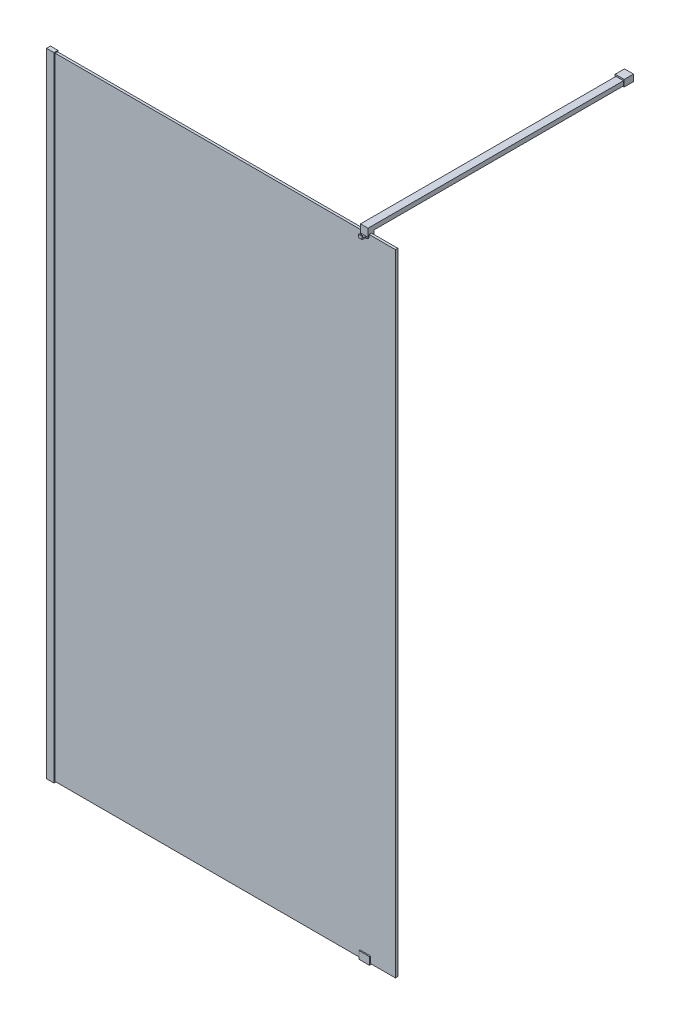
ISO-10303-21;
HEADER;
FILE_DESCRIPTION(('STEP AP214'),'2;1');
FILE_NAME('part.step','',(''),(''),'','','');
FILE_SCHEMA(('AUTOMOTIVE_DESIGN { 1 0 10303 214 1 1 1 1 }'));
ENDSEC;
DATA;
#1=APPLICATION_CONTEXT('core data for automotive mechanical design processes');
#2=APPLICATION_PROTOCOL_DEFINITION('international standard','automotive_design',2000,#1);
#3=PRODUCT_CONTEXT('',#1,'mechanical');
#4=PRODUCT('Part','Part','',(#3));
#5=PRODUCT_RELATED_PRODUCT_CATEGORY('part','',(#4));
#6=PRODUCT_DEFINITION_FORMATION('','',#4);
#7=PRODUCT_DEFINITION_CONTEXT('part definition',#1,'design');
#8=PRODUCT_DEFINITION('design','',#6,#7);
#9=PRODUCT_DEFINITION_SHAPE('','',#8);
#10=(LENGTH_UNIT() NAMED_UNIT(*) SI_UNIT(.MILLI.,.METRE.));
#11=(NAMED_UNIT(*) PLANE_ANGLE_UNIT() SI_UNIT($,.RADIAN.));
#12=(NAMED_UNIT(*) SI_UNIT($,.STERADIAN.) SOLID_ANGLE_UNIT());
#13=UNCERTAINTY_MEASURE_WITH_UNIT(LENGTH_MEASURE(1.E-05),#10,'distance_accuracy_value','');
#14=(GEOMETRIC_REPRESENTATION_CONTEXT(3) GLOBAL_UNCERTAINTY_ASSIGNED_CONTEXT((#13)) GLOBAL_UNIT_ASSIGNED_CONTEXT((#10,
#11,#12)) REPRESENTATION_CONTEXT('',''));
#15=CARTESIAN_POINT('',(0.,0.,0.));
#16=DIRECTION('',(0.,0.,1.));
#17=DIRECTION('',(1.,0.,0.));
#18=AXIS2_PLACEMENT_3D('',#15,#16,#17);
#19=CARTESIAN_POINT('',(1070.95,2090.,-19.4000000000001));
#20=DIRECTION('',(-1.,0.,0.));
#21=DIRECTION('',(0.,0.,1.));
#22=AXIS2_PLACEMENT_3D('',#19,#20,#21);
#23=PLANE('',#22);
#24=DIRECTION('',(0.,-1.,0.));
#25=VECTOR('',#24,1.);
#26=CARTESIAN_POINT('',(1070.95,2090.,-850.03));
#27=LINE('',#26,#25);
#28=CARTESIAN_POINT('',(1070.95,2120.,-850.03));
#29=VERTEX_POINT('',#28);
#30=CARTESIAN_POINT('',(1070.95,2105.,-850.03));
#31=VERTEX_POINT('',#30);
#32=EDGE_CURVE('E61',#29,#31,#27,.T.);
#33=ORIENTED_EDGE('',*,*,#32,.F.);
#34=DIRECTION('',(0.,0.,1.));
#35=VECTOR('',#34,1.);
#36=CARTESIAN_POINT('',(1070.95,2120.,0.599999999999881));
#37=LINE('',#36,#35);
#38=CARTESIAN_POINT('',(1070.95,2120.,0.599999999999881));
#39=VERTEX_POINT('',#38);
#40=EDGE_CURVE('E386',#29,#39,#37,.T.);
#41=ORIENTED_EDGE('',*,*,#40,.T.);
#42=DIRECTION('',(0.,-1.,0.));
#43=VECTOR('',#42,1.);
#44=CARTESIAN_POINT('',(1070.95,2094.,0.599999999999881));
#45=LINE('',#44,#43);
#46=CARTESIAN_POINT('',(1070.95,2094.,0.599999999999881));
#47=VERTEX_POINT('',#46);
#48=EDGE_CURVE('E388',#39,#47,#45,.T.);
#49=ORIENTED_EDGE('',*,*,#48,.T.);
#50=DIRECTION('',(0.,1.,0.));
#51=VECTOR('',#50,1.);
#52=CARTESIAN_POINT('',(1070.95,2090.,0.599999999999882));
#53=LINE('',#52,#51);
#54=CARTESIAN_POINT('',(1070.95,2090.,0.599999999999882));
#55=VERTEX_POINT('',#54);
#56=EDGE_CURVE('E332',#55,#47,#53,.T.);
#57=ORIENTED_EDGE('',*,*,#56,.F.);
#58=DIRECTION('',(0.,0.,-1.));
#59=VECTOR('',#58,1.);
#60=CARTESIAN_POINT('',(1070.95,2090.,-3.40000000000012));
#61=LINE('',#60,#59);
#62=CARTESIAN_POINT('',(1070.95,2090.,-3.40000000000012));
#63=VERTEX_POINT('',#62);
#64=EDGE_CURVE('E362',#55,#63,#61,.T.);
#65=ORIENTED_EDGE('',*,*,#64,.T.);
#66=DIRECTION('',(0.,1.,-1.30407837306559E-13));
#67=VECTOR('',#66,1.);
#68=CARTESIAN_POINT('',(1070.95,2100.,-3.40000000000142));
#69=LINE('',#68,#67);
#70=CARTESIAN_POINT('',(1070.95,2100.,-3.40000000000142));
#71=VERTEX_POINT('',#70);
#72=EDGE_CURVE('E392',#63,#71,#69,.T.);
#73=ORIENTED_EDGE('',*,*,#72,.T.);
#74=DIRECTION('',(0.,0.,-1.));
#75=VECTOR('',#74,1.);
#76=CARTESIAN_POINT('',(1070.95,2100.,-11.4000000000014));
#77=LINE('',#76,#75);
#78=CARTESIAN_POINT('',(1070.95,2100.,-11.4000000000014));
#79=VERTEX_POINT('',#78);
#80=EDGE_CURVE('E394',#71,#79,#77,.T.);
#81=ORIENTED_EDGE('',*,*,#80,.T.);
#82=DIRECTION('',(0.,-1.,1.30451205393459E-13));
#83=VECTOR('',#82,1.);
#84=CARTESIAN_POINT('',(1070.95,2090.,-11.4000000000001));
#85=LINE('',#84,#83);
#86=CARTESIAN_POINT('',(1070.95,2090.,-11.4000000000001));
#87=VERTEX_POINT('',#86);
#88=EDGE_CURVE('E395',#79,#87,#85,.T.);
#89=ORIENTED_EDGE('',*,*,#88,.T.);
#90=DIRECTION('',(0.,0.,-1.));
#91=VECTOR('',#90,1.);
#92=CARTESIAN_POINT('',(1070.95,2090.,-19.4000000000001));
#93=LINE('',#92,#91);
#94=CARTESIAN_POINT('',(1070.95,2090.,-19.4000000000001));
#95=VERTEX_POINT('',#94);
#96=EDGE_CURVE('E283',#87,#95,#93,.T.);
#97=ORIENTED_EDGE('',*,*,#96,.T.);
#98=DIRECTION('',(0.,1.,0.));
#99=VECTOR('',#98,1.);
#100=CARTESIAN_POINT('',(1070.95,2120.,-19.4000000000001));
#101=LINE('',#100,#99);
#102=CARTESIAN_POINT('',(1070.95,2105.,-19.4000000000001));
#103=VERTEX_POINT('',#102);
#104=EDGE_CURVE('E249',#95,#103,#101,.T.);
#105=ORIENTED_EDGE('',*,*,#104,.T.);
#106=DIRECTION('',(0.,0.,-1.));
#107=VECTOR('',#106,1.);
#108=CARTESIAN_POINT('',(1070.95,2105.,-881.03));
#109=LINE('',#108,#107);
#110=EDGE_CURVE('E248',#103,#31,#109,.T.);
#111=ORIENTED_EDGE('',*,*,#110,.T.);
#112=EDGE_LOOP('',(#33,#41,#49,#57,#65,#73,#81,#89,#97,#105,#111));
#113=FACE_BOUND('',#112,.T.);
#114=ADVANCED_FACE('F46',(#113),#23,.F.);
#115=CARTESIAN_POINT('',(1045.95,2090.,-19.4000000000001));
#116=DIRECTION('',(-1.,0.,0.));
#117=DIRECTION('',(0.,0.,1.));
#118=AXIS2_PLACEMENT_3D('',#115,#116,#117);
#119=PLANE('',#118);
#120=DIRECTION('',(0.,0.,1.));
#121=VECTOR('',#120,1.);
#122=CARTESIAN_POINT('',(1045.95,2120.,0.599999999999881));
#123=LINE('',#122,#121);
#124=CARTESIAN_POINT('',(1045.95,2120.,-850.03));
#125=VERTEX_POINT('',#124);
#126=CARTESIAN_POINT('',(1045.95,2120.,0.599999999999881));
#127=VERTEX_POINT('',#126);
#128=EDGE_CURVE('E272',#125,#127,#123,.T.);
#129=ORIENTED_EDGE('',*,*,#128,.F.);
#130=DIRECTION('',(0.,-1.,0.));
#131=VECTOR('',#130,1.);
#132=CARTESIAN_POINT('',(1045.95,2090.,-850.03));
#133=LINE('',#132,#131);
#134=CARTESIAN_POINT('',(1045.95,2105.,-850.03));
#135=VERTEX_POINT('',#134);
#136=EDGE_CURVE('E230',#125,#135,#133,.T.);
#137=ORIENTED_EDGE('',*,*,#136,.T.);
#138=DIRECTION('',(0.,0.,1.));
#139=VECTOR('',#138,1.);
#140=CARTESIAN_POINT('',(1045.95,2105.,-881.03));
#141=LINE('',#140,#139);
#142=CARTESIAN_POINT('',(1045.95,2105.,-19.4000000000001));
#143=VERTEX_POINT('',#142);
#144=EDGE_CURVE('E238',#135,#143,#141,.T.);
#145=ORIENTED_EDGE('',*,*,#144,.T.);
#146=DIRECTION('',(0.,1.,0.));
#147=VECTOR('',#146,1.);
#148=CARTESIAN_POINT('',(1045.95,2120.,-19.4000000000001));
#149=LINE('',#148,#147);
#150=CARTESIAN_POINT('',(1045.95,2090.,-19.4000000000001));
#151=VERTEX_POINT('',#150);
#152=EDGE_CURVE('E262',#151,#143,#149,.T.);
#153=ORIENTED_EDGE('',*,*,#152,.F.);
#154=DIRECTION('',(0.,0.,-1.));
#155=VECTOR('',#154,1.);
#156=CARTESIAN_POINT('',(1045.95,2090.,-19.4000000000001));
#157=LINE('',#156,#155);
#158=CARTESIAN_POINT('',(1045.95,2090.,-11.4000000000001));
#159=VERTEX_POINT('',#158);
#160=EDGE_CURVE('E296',#159,#151,#157,.T.);
#161=ORIENTED_EDGE('',*,*,#160,.F.);
#162=DIRECTION('',(0.,-1.,1.30451205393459E-13));
#163=VECTOR('',#162,1.);
#164=CARTESIAN_POINT('',(1045.95,2090.,-11.4000000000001));
#165=LINE('',#164,#163);
#166=CARTESIAN_POINT('',(1045.95,2100.,-11.4000000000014));
#167=VERTEX_POINT('',#166);
#168=EDGE_CURVE('E294',#167,#159,#165,.T.);
#169=ORIENTED_EDGE('',*,*,#168,.F.);
#170=DIRECTION('',(0.,0.,-1.));
#171=VECTOR('',#170,1.);
#172=CARTESIAN_POINT('',(1045.95,2100.,-11.4000000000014));
#173=LINE('',#172,#171);
#174=CARTESIAN_POINT('',(1045.95,2100.,-3.40000000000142));
#175=VERTEX_POINT('',#174);
#176=EDGE_CURVE('E292',#175,#167,#173,.T.);
#177=ORIENTED_EDGE('',*,*,#176,.F.);
#178=DIRECTION('',(0.,1.,-1.30407837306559E-13));
#179=VECTOR('',#178,1.);
#180=CARTESIAN_POINT('',(1045.95,2100.,-3.40000000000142));
#181=LINE('',#180,#179);
#182=CARTESIAN_POINT('',(1045.95,2090.,-3.40000000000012));
#183=VERTEX_POINT('',#182);
#184=EDGE_CURVE('E290',#183,#175,#181,.T.);
#185=ORIENTED_EDGE('',*,*,#184,.F.);
#186=DIRECTION('',(0.,0.,-1.));
#187=VECTOR('',#186,1.);
#188=CARTESIAN_POINT('',(1045.95,2090.,-3.40000000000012));
#189=LINE('',#188,#187);
#190=CARTESIAN_POINT('',(1045.95,2090.,0.599999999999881));
#191=VERTEX_POINT('',#190);
#192=EDGE_CURVE('E288',#191,#183,#189,.T.);
#193=ORIENTED_EDGE('',*,*,#192,.F.);
#194=DIRECTION('',(0.,1.,0.));
#195=VECTOR('',#194,1.);
#196=CARTESIAN_POINT('',(1045.95,2090.,0.599999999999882));
#197=LINE('',#196,#195);
#198=CARTESIAN_POINT('',(1045.95,2094.,0.599999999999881));
#199=VERTEX_POINT('',#198);
#200=EDGE_CURVE('E329',#191,#199,#197,.T.);
#201=ORIENTED_EDGE('',*,*,#200,.T.);
#202=DIRECTION('',(0.,-1.,0.));
#203=VECTOR('',#202,1.);
#204=CARTESIAN_POINT('',(1045.95,2094.,0.599999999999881));
#205=LINE('',#204,#203);
#206=EDGE_CURVE('E274',#127,#199,#205,.T.);
#207=ORIENTED_EDGE('',*,*,#206,.F.);
#208=EDGE_LOOP('',(#129,#137,#145,#153,#161,#169,#177,#185,#193,#201,#207));
#209=FACE_BOUND('',#208,.T.);
#210=ADVANCED_FACE('F259',(#209),#119,.T.);
#211=CARTESIAN_POINT('',(1070.95,2120.,0.599999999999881));
#212=DIRECTION('',(0.,-1.,0.));
#213=DIRECTION('',(0.,0.,-1.));
#214=AXIS2_PLACEMENT_3D('',#211,#212,#213);
#215=PLANE('',#214);
#216=DIRECTION('',(1.,0.,0.));
#217=VECTOR('',#216,1.);
#218=CARTESIAN_POINT('',(1070.95,2120.,-850.03));
#219=LINE('',#218,#217);
#220=EDGE_CURVE('E68',#125,#29,#219,.T.);
#221=ORIENTED_EDGE('',*,*,#220,.F.);
#222=ORIENTED_EDGE('',*,*,#128,.T.);
#223=DIRECTION('',(-1.,0.,0.));
#224=VECTOR('',#223,1.);
#225=CARTESIAN_POINT('',(1070.95,2120.,0.599999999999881));
#226=LINE('',#225,#224);
#227=EDGE_CURVE('E326',#39,#127,#226,.T.);
#228=ORIENTED_EDGE('',*,*,#227,.F.);
#229=ORIENTED_EDGE('',*,*,#40,.F.);
#230=EDGE_LOOP('',(#221,#222,#228,#229));
#231=FACE_BOUND('',#230,.T.);
#232=ADVANCED_FACE('F437',(#231),#215,.F.);
#233=CARTESIAN_POINT('',(1045.95,2105.,-19.4000000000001));
#234=DIRECTION('',(0.,1.,0.));
#235=DIRECTION('',(0.,0.,1.));
#236=AXIS2_PLACEMENT_3D('',#233,#234,#235);
#237=PLANE('',#236);
#238=DIRECTION('',(-1.,0.,0.));
#239=VECTOR('',#238,1.);
#240=CARTESIAN_POINT('',(1045.95,2105.,-850.03));
#241=LINE('',#240,#239);
#242=EDGE_CURVE('E12',#31,#135,#241,.T.);
#243=ORIENTED_EDGE('',*,*,#242,.F.);
#244=ORIENTED_EDGE('',*,*,#110,.F.);
#245=DIRECTION('',(1.,0.,0.));
#246=VECTOR('',#245,1.);
#247=CARTESIAN_POINT('',(1045.95,2105.,-19.4000000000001));
#248=LINE('',#247,#246);
#249=EDGE_CURVE('E244',#143,#103,#248,.T.);
#250=ORIENTED_EDGE('',*,*,#249,.F.);
#251=ORIENTED_EDGE('',*,*,#144,.F.);
#252=EDGE_LOOP('',(#243,#244,#250,#251));
#253=FACE_BOUND('',#252,.T.);
#254=ADVANCED_FACE('F265',(#253),#237,.F.);
#255=CARTESIAN_POINT('',(1070.95,2094.,9.84506801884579));
#256=DIRECTION('',(0.,-1.,0.));
#257=DIRECTION('',(0.,0.,-1.));
#258=AXIS2_PLACEMENT_3D('',#255,#256,#257);
#259=PLANE('',#258);
#260=DIRECTION('',(-0.906307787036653,0.,-0.422618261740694));
#261=VECTOR('',#260,1.);
#262=CARTESIAN_POINT('',(1070.02591161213,2094.,11.8267819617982));
#263=LINE('',#262,#261);
#264=CARTESIAN_POINT('',(1052.45,2094.,3.6309997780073));
#265=VERTEX_POINT('',#264);
#266=EDGE_CURVE('E365',#265,#199,#263,.T.);
#267=ORIENTED_EDGE('',*,*,#266,.F.);
#268=DIRECTION('',(0.,0.,-1.));
#269=VECTOR('',#268,1.);
#270=CARTESIAN_POINT('',(1052.45,2094.,9.84506801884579));
#271=LINE('',#270,#269);
#272=CARTESIAN_POINT('',(1052.45,2094.,9.84506801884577));
#273=VERTEX_POINT('',#272);
#274=EDGE_CURVE('E273',#273,#265,#271,.T.);
#275=ORIENTED_EDGE('',*,*,#274,.F.);
#276=DIRECTION('',(-1.,0.,0.));
#277=VECTOR('',#276,1.);
#278=CARTESIAN_POINT('',(1070.95,2094.,9.84506801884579));
#279=LINE('',#278,#277);
#280=CARTESIAN_POINT('',(1064.45,2094.,9.84506801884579));
#281=VERTEX_POINT('',#280);
#282=EDGE_CURVE('E320',#281,#273,#279,.T.);
#283=ORIENTED_EDGE('',*,*,#282,.F.);
#284=DIRECTION('',(0.,0.,1.));
#285=VECTOR('',#284,1.);
#286=CARTESIAN_POINT('',(1064.45,2094.,9.84506801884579));
#287=LINE('',#286,#285);
#288=CARTESIAN_POINT('',(1064.45,2094.,3.63099977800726));
#289=VERTEX_POINT('',#288);
#290=EDGE_CURVE('E379',#289,#281,#287,.T.);
#291=ORIENTED_EDGE('',*,*,#290,.F.);
#292=DIRECTION('',(-0.906307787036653,0.,0.422618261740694));
#293=VECTOR('',#292,1.);
#294=CARTESIAN_POINT('',(1067.40893350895,2094.,2.25122642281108));
#295=LINE('',#294,#293);
#296=EDGE_CURVE('E364',#47,#289,#295,.T.);
#297=ORIENTED_EDGE('',*,*,#296,.F.);
#298=DIRECTION('',(-1.,0.,0.));
#299=VECTOR('',#298,1.);
#300=CARTESIAN_POINT('',(1070.95,2094.,0.599999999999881));
#301=LINE('',#300,#299);
#302=EDGE_CURVE('E323',#47,#199,#301,.T.);
#303=ORIENTED_EDGE('',*,*,#302,.T.);
#304=EDGE_LOOP('',(#267,#275,#283,#291,#297,#303));
#305=FACE_BOUND('',#304,.T.);
#306=ADVANCED_FACE('F424',(#305),#259,.F.);
#307=CARTESIAN_POINT('',(1070.95,2100.,10.3700000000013));
#308=DIRECTION('',(0.,-0.087155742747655,0.996194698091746));
#309=DIRECTION('',(0.,-0.996194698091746,-0.087155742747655));
#310=AXIS2_PLACEMENT_3D('',#307,#308,#309);
#311=PLANE('',#310);
#312=DIRECTION('',(0.,-0.996194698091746,-0.087155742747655));
#313=VECTOR('',#312,1.);
#314=CARTESIAN_POINT('',(1052.45,2100.,10.3700000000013));
#315=LINE('',#314,#313);
#316=CARTESIAN_POINT('',(1052.45,2100.,10.3700000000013));
#317=VERTEX_POINT('',#316);
#318=EDGE_CURVE('E276',#317,#273,#315,.T.);
#319=ORIENTED_EDGE('',*,*,#318,.F.);
#320=DIRECTION('',(-1.,0.,0.));
#321=VECTOR('',#320,1.);
#322=CARTESIAN_POINT('',(1070.95,2100.,10.3700000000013));
#323=LINE('',#322,#321);
#324=CARTESIAN_POINT('',(1064.45,2100.,10.3700000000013));
#325=VERTEX_POINT('',#324);
#326=EDGE_CURVE('E317',#325,#317,#323,.T.);
#327=ORIENTED_EDGE('',*,*,#326,.F.);
#328=DIRECTION('',(0.,0.996194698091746,0.087155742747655));
#329=VECTOR('',#328,1.);
#330=CARTESIAN_POINT('',(1064.45,2100.,10.3700000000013));
#331=LINE('',#330,#329);
#332=EDGE_CURVE('E376',#281,#325,#331,.T.);
#333=ORIENTED_EDGE('',*,*,#332,.F.);
#334=ORIENTED_EDGE('',*,*,#282,.T.);
#335=EDGE_LOOP('',(#319,#327,#333,#334));
#336=FACE_BOUND('',#335,.T.);
#337=ADVANCED_FACE('F428',(#336),#311,.F.);
#338=CARTESIAN_POINT('',(1070.95,2100.,13.3700000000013));
#339=DIRECTION('',(0.,-1.,1.48029736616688E-13));
#340=DIRECTION('',(0.,-1.48029736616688E-13,-1.));
#341=AXIS2_PLACEMENT_3D('',#338,#339,#340);
#342=PLANE('',#341);
#343=DIRECTION('',(0.,-1.48029736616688E-13,-1.));
#344=VECTOR('',#343,1.);
#345=CARTESIAN_POINT('',(1052.45,2100.,13.3700000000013));
#346=LINE('',#345,#344);
#347=CARTESIAN_POINT('',(1052.45,2100.,13.3700000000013));
#348=VERTEX_POINT('',#347);
#349=EDGE_CURVE('E382',#348,#317,#346,.T.);
#350=ORIENTED_EDGE('',*,*,#349,.F.);
#351=DIRECTION('',(-1.,0.,0.));
#352=VECTOR('',#351,1.);
#353=CARTESIAN_POINT('',(1070.95,2100.,13.3700000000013));
#354=LINE('',#353,#352);
#355=CARTESIAN_POINT('',(1064.45,2100.,13.3700000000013));
#356=VERTEX_POINT('',#355);
#357=EDGE_CURVE('E314',#356,#348,#354,.T.);
#358=ORIENTED_EDGE('',*,*,#357,.F.);
#359=DIRECTION('',(0.,1.48029736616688E-13,1.));
#360=VECTOR('',#359,1.);
#361=CARTESIAN_POINT('',(1064.45,2100.,13.3700000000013));
#362=LINE('',#361,#360);
#363=EDGE_CURVE('E368',#325,#356,#362,.T.);
#364=ORIENTED_EDGE('',*,*,#363,.F.);
#365=ORIENTED_EDGE('',*,*,#326,.T.);
#366=EDGE_LOOP('',(#350,#358,#364,#365));
#367=FACE_BOUND('',#366,.T.);
#368=ADVANCED_FACE('F431',(#367),#342,.F.);
#369=CARTESIAN_POINT('',(1070.95,2090.,13.3700000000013));
#370=DIRECTION('',(0.,0.,-1.));
#371=DIRECTION('',(0.,1.,0.));
#372=AXIS2_PLACEMENT_3D('',#369,#370,#371);
#373=PLANE('',#372);
#374=ORIENTED_EDGE('',*,*,#357,.T.);
#375=DIRECTION('',(0.,-1.,0.));
#376=VECTOR('',#375,1.);
#377=CARTESIAN_POINT('',(1052.45,7752.15073308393,13.3700000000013));
#378=LINE('',#377,#376);
#379=CARTESIAN_POINT('',(1052.45,2090.,13.3700000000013));
#380=VERTEX_POINT('',#379);
#381=EDGE_CURVE('E345',#348,#380,#378,.T.);
#382=ORIENTED_EDGE('',*,*,#381,.T.);
#383=DIRECTION('',(-1.,0.,0.));
#384=VECTOR('',#383,1.);
#385=CARTESIAN_POINT('',(1070.95,2090.,13.3700000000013));
#386=LINE('',#385,#384);
#387=CARTESIAN_POINT('',(1064.45,2090.,13.3700000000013));
#388=VERTEX_POINT('',#387);
#389=EDGE_CURVE('E311',#388,#380,#386,.T.);
#390=ORIENTED_EDGE('',*,*,#389,.F.);
#391=DIRECTION('',(0.,-1.,0.));
#392=VECTOR('',#391,1.);
#393=CARTESIAN_POINT('',(1064.45,7752.15073308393,13.3700000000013));
#394=LINE('',#393,#392);
#395=EDGE_CURVE('E355',#356,#388,#394,.T.);
#396=ORIENTED_EDGE('',*,*,#395,.F.);
#397=EDGE_LOOP('',(#374,#382,#390,#396));
#398=FACE_BOUND('',#397,.T.);
#399=ADVANCED_FACE('F353',(#398),#373,.F.);
#400=CARTESIAN_POINT('',(1070.95,2090.,-3.40000000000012));
#401=DIRECTION('',(0.,1.,0.));
#402=DIRECTION('',(0.,0.,1.));
#403=AXIS2_PLACEMENT_3D('',#400,#401,#402);
#404=PLANE('',#403);
#405=DIRECTION('',(0.906307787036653,0.,0.422618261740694));
#406=VECTOR('',#405,1.);
#407=CARTESIAN_POINT('',(1064.95275623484,2090.,9.46113075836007));
#408=LINE('',#407,#406);
#409=CARTESIAN_POINT('',(1052.45,2090.,3.6309997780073));
#410=VERTEX_POINT('',#409);
#411=EDGE_CURVE('E370',#191,#410,#408,.T.);
#412=ORIENTED_EDGE('',*,*,#411,.F.);
#413=ORIENTED_EDGE('',*,*,#192,.T.);
#414=DIRECTION('',(-1.,0.,0.));
#415=VECTOR('',#414,1.);
#416=CARTESIAN_POINT('',(1070.95,2090.,-3.40000000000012));
#417=LINE('',#416,#415);
#418=EDGE_CURVE('E308',#63,#183,#417,.T.);
#419=ORIENTED_EDGE('',*,*,#418,.F.);
#420=ORIENTED_EDGE('',*,*,#64,.F.);
#421=DIRECTION('',(0.906307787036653,0.,-0.422618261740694));
#422=VECTOR('',#421,1.);
#423=CARTESIAN_POINT('',(1072.48208888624,2090.,-0.114424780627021));
#424=LINE('',#423,#422);
#425=CARTESIAN_POINT('',(1064.45,2090.,3.6309997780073));
#426=VERTEX_POINT('',#425);
#427=EDGE_CURVE('E360',#426,#55,#424,.T.);
#428=ORIENTED_EDGE('',*,*,#427,.F.);
#429=DIRECTION('',(0.,0.,-1.));
#430=VECTOR('',#429,1.);
#431=CARTESIAN_POINT('',(1064.45,2090.,-3.40000000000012));
#432=LINE('',#431,#430);
#433=EDGE_CURVE('E334',#388,#426,#432,.T.);
#434=ORIENTED_EDGE('',*,*,#433,.F.);
#435=ORIENTED_EDGE('',*,*,#389,.T.);
#436=DIRECTION('',(0.,0.,1.));
#437=VECTOR('',#436,1.);
#438=CARTESIAN_POINT('',(1052.45,2090.,-3.40000000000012));
#439=LINE('',#438,#437);
#440=EDGE_CURVE('E54',#410,#380,#439,.T.);
#441=ORIENTED_EDGE('',*,*,#440,.F.);
#442=EDGE_LOOP('',(#412,#413,#419,#420,#428,#434,#435,#441));
#443=FACE_BOUND('',#442,.T.);
#444=ADVANCED_FACE('F357',(#443),#404,.F.);
#445=CARTESIAN_POINT('',(1070.95,2120.,-19.4000000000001));
#446=DIRECTION('',(0.,0.,1.));
#447=DIRECTION('',(0.,-1.,0.));
#448=AXIS2_PLACEMENT_3D('',#445,#446,#447);
#449=PLANE('',#448);
#450=ORIENTED_EDGE('',*,*,#152,.T.);
#451=ORIENTED_EDGE('',*,*,#249,.T.);
#452=ORIENTED_EDGE('',*,*,#104,.F.);
#453=DIRECTION('',(-1.,0.,0.));
#454=VECTOR('',#453,1.);
#455=CARTESIAN_POINT('',(1070.95,2090.,-19.4000000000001));
#456=LINE('',#455,#454);
#457=EDGE_CURVE('E271',#95,#151,#456,.T.);
#458=ORIENTED_EDGE('',*,*,#457,.T.);
#459=EDGE_LOOP('',(#450,#451,#452,#458));
#460=FACE_BOUND('',#459,.T.);
#461=ADVANCED_FACE('F48',(#460),#449,.F.);
#462=CARTESIAN_POINT('',(1070.95,2094.,0.599999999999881));
#463=DIRECTION('',(0.,0.,-1.));
#464=DIRECTION('',(0.,1.,0.));
#465=AXIS2_PLACEMENT_3D('',#462,#463,#464);
#466=PLANE('',#465);
#467=ORIENTED_EDGE('',*,*,#206,.T.);
#468=ORIENTED_EDGE('',*,*,#302,.F.);
#469=ORIENTED_EDGE('',*,*,#48,.F.);
#470=ORIENTED_EDGE('',*,*,#227,.T.);
#471=EDGE_LOOP('',(#467,#468,#469,#470));
#472=FACE_BOUND('',#471,.T.);
#473=ADVANCED_FACE('F435',(#472),#466,.F.);
#474=CARTESIAN_POINT('',(1070.95,2100.,-3.40000000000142));
#475=DIRECTION('',(0.,1.30407837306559E-13,1.));
#476=DIRECTION('',(0.,-1.,1.30407837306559E-13));
#477=AXIS2_PLACEMENT_3D('',#474,#475,#476);
#478=PLANE('',#477);
#479=ORIENTED_EDGE('',*,*,#184,.T.);
#480=DIRECTION('',(-1.,0.,0.));
#481=VECTOR('',#480,1.);
#482=CARTESIAN_POINT('',(1070.95,2100.,-3.40000000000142));
#483=LINE('',#482,#481);
#484=EDGE_CURVE('E305',#71,#175,#483,.T.);
#485=ORIENTED_EDGE('',*,*,#484,.F.);
#486=ORIENTED_EDGE('',*,*,#72,.F.);
#487=ORIENTED_EDGE('',*,*,#418,.T.);
#488=EDGE_LOOP('',(#479,#485,#486,#487));
#489=FACE_BOUND('',#488,.T.);
#490=ADVANCED_FACE('F413',(#489),#478,.F.);
#491=CARTESIAN_POINT('',(1070.95,2100.,-11.4000000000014));
#492=DIRECTION('',(0.,1.,0.));
#493=DIRECTION('',(0.,0.,1.));
#494=AXIS2_PLACEMENT_3D('',#491,#492,#493);
#495=PLANE('',#494);
#496=ORIENTED_EDGE('',*,*,#176,.T.);
#497=DIRECTION('',(-1.,0.,0.));
#498=VECTOR('',#497,1.);
#499=CARTESIAN_POINT('',(1070.95,2100.,-11.4000000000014));
#500=LINE('',#499,#498);
#501=EDGE_CURVE('E302',#79,#167,#500,.T.);
#502=ORIENTED_EDGE('',*,*,#501,.F.);
#503=ORIENTED_EDGE('',*,*,#80,.F.);
#504=ORIENTED_EDGE('',*,*,#484,.T.);
#505=EDGE_LOOP('',(#496,#502,#503,#504));
#506=FACE_BOUND('',#505,.T.);
#507=ADVANCED_FACE('F409',(#506),#495,.F.);
#508=CARTESIAN_POINT('',(1070.95,2090.,-11.4000000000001));
#509=DIRECTION('',(0.,-1.30451205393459E-13,-1.));
#510=DIRECTION('',(0.,1.,-1.30451205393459E-13));
#511=AXIS2_PLACEMENT_3D('',#508,#509,#510);
#512=PLANE('',#511);
#513=ORIENTED_EDGE('',*,*,#168,.T.);
#514=DIRECTION('',(-1.,0.,0.));
#515=VECTOR('',#514,1.);
#516=CARTESIAN_POINT('',(1070.95,2090.,-11.4000000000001));
#517=LINE('',#516,#515);
#518=EDGE_CURVE('E299',#87,#159,#517,.T.);
#519=ORIENTED_EDGE('',*,*,#518,.F.);
#520=ORIENTED_EDGE('',*,*,#88,.F.);
#521=ORIENTED_EDGE('',*,*,#501,.T.);
#522=EDGE_LOOP('',(#513,#519,#520,#521));
#523=FACE_BOUND('',#522,.T.);
#524=ADVANCED_FACE('F405',(#523),#512,.F.);
#525=CARTESIAN_POINT('',(1070.95,2090.,-19.4000000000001));
#526=DIRECTION('',(0.,1.,0.));
#527=DIRECTION('',(0.,0.,1.));
#528=AXIS2_PLACEMENT_3D('',#525,#526,#527);
#529=PLANE('',#528);
#530=ORIENTED_EDGE('',*,*,#160,.T.);
#531=ORIENTED_EDGE('',*,*,#457,.F.);
#532=ORIENTED_EDGE('',*,*,#96,.F.);
#533=ORIENTED_EDGE('',*,*,#518,.T.);
#534=EDGE_LOOP('',(#530,#531,#532,#533));
#535=FACE_BOUND('',#534,.T.);
#536=ADVANCED_FACE('F400',(#535),#529,.F.);
#537=CARTESIAN_POINT('',(1045.95,7752.15073308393,0.599999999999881));
#538=DIRECTION('',(-0.422618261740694,0.,0.906307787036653));
#539=DIRECTION('',(0.906307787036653,0.,0.422618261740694));
#540=AXIS2_PLACEMENT_3D('',#537,#538,#539);
#541=PLANE('',#540);
#542=DIRECTION('',(0.,-1.,0.));
#543=VECTOR('',#542,1.);
#544=CARTESIAN_POINT('',(1052.45,7752.15073308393,3.6309997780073));
#545=LINE('',#544,#543);
#546=EDGE_CURVE('E348',#265,#410,#545,.T.);
#547=ORIENTED_EDGE('',*,*,#546,.F.);
#548=ORIENTED_EDGE('',*,*,#266,.T.);
#549=ORIENTED_EDGE('',*,*,#200,.F.);
#550=ORIENTED_EDGE('',*,*,#411,.T.);
#551=EDGE_LOOP('',(#547,#548,#549,#550));
#552=FACE_BOUND('',#551,.T.);
#553=ADVANCED_FACE('F432',(#552),#541,.T.);
#554=CARTESIAN_POINT('',(1052.45,7752.15073308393,3.6309997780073));
#555=DIRECTION('',(-1.,0.,0.));
#556=DIRECTION('',(0.,0.,1.));
#557=AXIS2_PLACEMENT_3D('',#554,#555,#556);
#558=PLANE('',#557);
#559=ORIENTED_EDGE('',*,*,#318,.T.);
#560=ORIENTED_EDGE('',*,*,#274,.T.);
#561=ORIENTED_EDGE('',*,*,#546,.T.);
#562=ORIENTED_EDGE('',*,*,#440,.T.);
#563=ORIENTED_EDGE('',*,*,#381,.F.);
#564=ORIENTED_EDGE('',*,*,#349,.T.);
#565=EDGE_LOOP('',(#559,#560,#561,#562,#563,#564));
#566=FACE_BOUND('',#565,.T.);
#567=ADVANCED_FACE('F344',(#566),#558,.T.);
#568=CARTESIAN_POINT('',(1064.45,7752.15073308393,3.6309997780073));
#569=DIRECTION('',(1.,0.,0.));
#570=DIRECTION('',(0.,0.,-1.));
#571=AXIS2_PLACEMENT_3D('',#568,#569,#570);
#572=PLANE('',#571);
#573=DIRECTION('',(0.,-1.,0.));
#574=VECTOR('',#573,1.);
#575=CARTESIAN_POINT('',(1064.45,7752.15073308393,3.6309997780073));
#576=LINE('',#575,#574);
#577=EDGE_CURVE('E241',#289,#426,#576,.T.);
#578=ORIENTED_EDGE('',*,*,#577,.F.);
#579=ORIENTED_EDGE('',*,*,#290,.T.);
#580=ORIENTED_EDGE('',*,*,#332,.T.);
#581=ORIENTED_EDGE('',*,*,#363,.T.);
#582=ORIENTED_EDGE('',*,*,#395,.T.);
#583=ORIENTED_EDGE('',*,*,#433,.T.);
#584=EDGE_LOOP('',(#578,#579,#580,#581,#582,#583));
#585=FACE_BOUND('',#584,.T.);
#586=ADVANCED_FACE('F420',(#585),#572,.T.);
#587=CARTESIAN_POINT('',(1070.95,7752.15073308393,0.599999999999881));
#588=DIRECTION('',(0.422618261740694,0.,0.906307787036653));
#589=DIRECTION('',(0.906307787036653,0.,-0.422618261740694));
#590=AXIS2_PLACEMENT_3D('',#587,#588,#589);
#591=PLANE('',#590);
#592=ORIENTED_EDGE('',*,*,#56,.T.);
#593=ORIENTED_EDGE('',*,*,#296,.T.);
#594=ORIENTED_EDGE('',*,*,#577,.T.);
#595=ORIENTED_EDGE('',*,*,#427,.T.);
#596=EDGE_LOOP('',(#592,#593,#594,#595));
#597=FACE_BOUND('',#596,.T.);
#598=ADVANCED_FACE('F418',(#597),#591,.T.);
#599=CARTESIAN_POINT('',(1043.44999999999,2103.,-850.03));
#600=DIRECTION('',(0.,0.,-1.));
#601=DIRECTION('',(-1.,0.,0.));
#602=AXIS2_PLACEMENT_3D('',#599,#600,#601);
#603=PLANE('',#602);
#604=DIRECTION('',(0.,1.,0.));
#605=VECTOR('',#604,1.);
#606=CARTESIAN_POINT('',(1043.44999999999,2125.,-850.03));
#607=LINE('',#606,#605);
#608=CARTESIAN_POINT('',(1043.44999999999,2103.,-850.03));
#609=VERTEX_POINT('',#608);
#610=CARTESIAN_POINT('',(1043.44999999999,2125.,-850.03));
#611=VERTEX_POINT('',#610);
#612=EDGE_CURVE('E209',#609,#611,#607,.T.);
#613=ORIENTED_EDGE('',*,*,#612,.F.);
#614=DIRECTION('',(-1.,0.,0.));
#615=VECTOR('',#614,1.);
#616=CARTESIAN_POINT('',(1073.44999999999,2103.,-850.03));
#617=LINE('',#616,#615);
#618=CARTESIAN_POINT('',(1073.44999999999,2103.,-850.03));
#619=VERTEX_POINT('',#618);
#620=EDGE_CURVE('E201',#619,#609,#617,.T.);
#621=ORIENTED_EDGE('',*,*,#620,.F.);
#622=DIRECTION('',(0.,-1.,0.));
#623=VECTOR('',#622,1.);
#624=CARTESIAN_POINT('',(1073.44999999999,2125.,-850.03));
#625=LINE('',#624,#623);
#626=CARTESIAN_POINT('',(1073.44999999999,2125.,-850.03));
#627=VERTEX_POINT('',#626);
#628=EDGE_CURVE('E212',#627,#619,#625,.T.);
#629=ORIENTED_EDGE('',*,*,#628,.F.);
#630=DIRECTION('',(1.,0.,0.));
#631=VECTOR('',#630,1.);
#632=CARTESIAN_POINT('',(1073.44999999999,2125.,-850.03));
#633=LINE('',#632,#631);
#634=EDGE_CURVE('E193',#611,#627,#633,.T.);
#635=ORIENTED_EDGE('',*,*,#634,.F.);
#636=EDGE_LOOP('',(#613,#621,#629,#635));
#637=FACE_BOUND('',#636,.T.);
#638=ORIENTED_EDGE('',*,*,#136,.F.);
#639=ORIENTED_EDGE('',*,*,#220,.T.);
#640=ORIENTED_EDGE('',*,*,#32,.T.);
#641=ORIENTED_EDGE('',*,*,#242,.T.);
#642=EDGE_LOOP('',(#638,#639,#640,#641));
#643=FACE_BOUND('',#642,.T.);
#644=ADVANCED_FACE('F206',(#637,#643),#603,.F.);
#645=CARTESIAN_POINT('',(1043.44999999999,2125.,-850.03));
#646=DIRECTION('',(-1.,0.,0.));
#647=DIRECTION('',(0.,0.,1.));
#648=AXIS2_PLACEMENT_3D('',#645,#646,#647);
#649=PLANE('',#648);
#650=DIRECTION('',(0.,1.,0.));
#651=VECTOR('',#650,1.);
#652=CARTESIAN_POINT('',(1043.44999999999,2125.,-881.03));
#653=LINE('',#652,#651);
#654=CARTESIAN_POINT('',(1043.44999999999,2103.,-881.03));
#655=VERTEX_POINT('',#654);
#656=CARTESIAN_POINT('',(1043.44999999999,2125.,-881.03));
#657=VERTEX_POINT('',#656);
#658=EDGE_CURVE('E224',#655,#657,#653,.T.);
#659=ORIENTED_EDGE('',*,*,#658,.F.);
#660=DIRECTION('',(0.,0.,-1.));
#661=VECTOR('',#660,1.);
#662=CARTESIAN_POINT('',(1043.44999999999,2103.,-850.03));
#663=LINE('',#662,#661);
#664=EDGE_CURVE('E215',#609,#655,#663,.T.);
#665=ORIENTED_EDGE('',*,*,#664,.F.);
#666=ORIENTED_EDGE('',*,*,#612,.T.);
#667=DIRECTION('',(0.,0.,-1.));
#668=VECTOR('',#667,1.);
#669=CARTESIAN_POINT('',(1043.44999999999,2125.,-850.03));
#670=LINE('',#669,#668);
#671=EDGE_CURVE('E190',#611,#657,#670,.T.);
#672=ORIENTED_EDGE('',*,*,#671,.T.);
#673=EDGE_LOOP('',(#659,#665,#666,#672));
#674=FACE_BOUND('',#673,.T.);
#675=ADVANCED_FACE('F214',(#674),#649,.T.);
#676=CARTESIAN_POINT('',(1073.44999999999,2103.,-850.03));
#677=DIRECTION('',(0.,-1.,0.));
#678=DIRECTION('',(0.,0.,-1.));
#679=AXIS2_PLACEMENT_3D('',#676,#677,#678);
#680=PLANE('',#679);
#681=DIRECTION('',(-1.,0.,0.));
#682=VECTOR('',#681,1.);
#683=CARTESIAN_POINT('',(1073.44999999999,2103.,-881.03));
#684=LINE('',#683,#682);
#685=CARTESIAN_POINT('',(1073.44999999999,2103.,-881.03));
#686=VERTEX_POINT('',#685);
#687=EDGE_CURVE('E216',#686,#655,#684,.T.);
#688=ORIENTED_EDGE('',*,*,#687,.F.);
#689=DIRECTION('',(0.,0.,-1.));
#690=VECTOR('',#689,1.);
#691=CARTESIAN_POINT('',(1073.44999999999,2103.,-850.03));
#692=LINE('',#691,#690);
#693=EDGE_CURVE('E231',#619,#686,#692,.T.);
#694=ORIENTED_EDGE('',*,*,#693,.F.);
#695=ORIENTED_EDGE('',*,*,#620,.T.);
#696=ORIENTED_EDGE('',*,*,#664,.T.);
#697=EDGE_LOOP('',(#688,#694,#695,#696));
#698=FACE_BOUND('',#697,.T.);
#699=ADVANCED_FACE('F444',(#698),#680,.T.);
#700=CARTESIAN_POINT('',(1073.44999999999,2125.,-850.03));
#701=DIRECTION('',(1.,0.,0.));
#702=DIRECTION('',(0.,0.,-1.));
#703=AXIS2_PLACEMENT_3D('',#700,#701,#702);
#704=PLANE('',#703);
#705=DIRECTION('',(0.,-1.,0.));
#706=VECTOR('',#705,1.);
#707=CARTESIAN_POINT('',(1073.44999999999,2125.,-881.03));
#708=LINE('',#707,#706);
#709=CARTESIAN_POINT('',(1073.44999999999,2125.,-881.03));
#710=VERTEX_POINT('',#709);
#711=EDGE_CURVE('E219',#710,#686,#708,.T.);
#712=ORIENTED_EDGE('',*,*,#711,.F.);
#713=DIRECTION('',(0.,0.,-1.));
#714=VECTOR('',#713,1.);
#715=CARTESIAN_POINT('',(1073.44999999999,2125.,-850.03));
#716=LINE('',#715,#714);
#717=EDGE_CURVE('E200',#627,#710,#716,.T.);
#718=ORIENTED_EDGE('',*,*,#717,.F.);
#719=ORIENTED_EDGE('',*,*,#628,.T.);
#720=ORIENTED_EDGE('',*,*,#693,.T.);
#721=EDGE_LOOP('',(#712,#718,#719,#720));
#722=FACE_BOUND('',#721,.T.);
#723=ADVANCED_FACE('F612',(#722),#704,.T.);
#724=CARTESIAN_POINT('',(1073.44999999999,2125.,-850.03));
#725=DIRECTION('',(0.,1.,0.));
#726=DIRECTION('',(0.,0.,1.));
#727=AXIS2_PLACEMENT_3D('',#724,#725,#726);
#728=PLANE('',#727);
#729=DIRECTION('',(1.,0.,0.));
#730=VECTOR('',#729,1.);
#731=CARTESIAN_POINT('',(1073.44999999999,2125.,-881.03));
#732=LINE('',#731,#730);
#733=EDGE_CURVE('E195',#657,#710,#732,.T.);
#734=ORIENTED_EDGE('',*,*,#733,.F.);
#735=ORIENTED_EDGE('',*,*,#671,.F.);
#736=ORIENTED_EDGE('',*,*,#634,.T.);
#737=ORIENTED_EDGE('',*,*,#717,.T.);
#738=EDGE_LOOP('',(#734,#735,#736,#737));
#739=FACE_BOUND('',#738,.T.);
#740=ADVANCED_FACE('F192',(#739),#728,.T.);
#741=CARTESIAN_POINT('',(1045.95,2105.,-881.03));
#742=DIRECTION('',(0.,0.,-1.));
#743=DIRECTION('',(-1.,0.,0.));
#744=AXIS2_PLACEMENT_3D('',#741,#742,#743);
#745=PLANE('',#744);
#746=ORIENTED_EDGE('',*,*,#658,.T.);
#747=ORIENTED_EDGE('',*,*,#733,.T.);
#748=ORIENTED_EDGE('',*,*,#711,.T.);
#749=ORIENTED_EDGE('',*,*,#687,.T.);
#750=EDGE_LOOP('',(#746,#747,#748,#749));
#751=FACE_BOUND('',#750,.T.);
#752=ADVANCED_FACE('F485',(#751),#745,.T.);
#753=CLOSED_SHELL('',(#114,#210,#232,#254,#306,#337,#368,#399,#444,#461,#473,#490,#507,#524,
#536,#553,#567,#586,#598,#644,#675,#699,#723,#740,#752));
#754=MANIFOLD_SOLID_BREP('B2',#753);
#755=CARTESIAN_POINT('',(1075.95,22.,-11.4000000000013));
#756=DIRECTION('',(0.,0.,-1.));
#757=DIRECTION('',(0.,1.,0.));
#758=AXIS2_PLACEMENT_3D('',#755,#756,#757);
#759=PLANE('',#758);
#760=DIRECTION('',(0.,-1.,0.));
#761=VECTOR('',#760,1.);
#762=CARTESIAN_POINT('',(1040.95,22.,-11.4000000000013));
#763=LINE('',#762,#761);
#764=CARTESIAN_POINT('',(1040.95,22.,-11.4000000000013));
#765=VERTEX_POINT('',#764);
#766=CARTESIAN_POINT('',(1040.95,0.,-11.4));
#767=VERTEX_POINT('',#766);
#768=EDGE_CURVE('E765',#765,#767,#763,.T.);
#769=ORIENTED_EDGE('',*,*,#768,.T.);
#770=DIRECTION('',(-1.,0.,0.));
#771=VECTOR('',#770,1.);
#772=CARTESIAN_POINT('',(1075.95,0.,-11.4));
#773=LINE('',#772,#771);
#774=CARTESIAN_POINT('',(1075.95,0.,-11.4));
#775=VERTEX_POINT('',#774);
#776=EDGE_CURVE('E44',#775,#767,#773,.T.);
#777=ORIENTED_EDGE('',*,*,#776,.F.);
#778=DIRECTION('',(0.,-1.,0.));
#779=VECTOR('',#778,1.);
#780=CARTESIAN_POINT('',(1075.95,22.,-11.4000000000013));
#781=LINE('',#780,#779);
#782=CARTESIAN_POINT('',(1075.95,22.,-11.4000000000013));
#783=VERTEX_POINT('',#782);
#784=EDGE_CURVE('E779',#783,#775,#781,.T.);
#785=ORIENTED_EDGE('',*,*,#784,.F.);
#786=DIRECTION('',(-1.,0.,0.));
#787=VECTOR('',#786,1.);
#788=CARTESIAN_POINT('',(1075.95,22.,-11.4000000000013));
#789=LINE('',#788,#787);
#790=EDGE_CURVE('E761',#783,#765,#789,.T.);
#791=ORIENTED_EDGE('',*,*,#790,.T.);
#792=EDGE_LOOP('',(#769,#777,#785,#791));
#793=FACE_BOUND('',#792,.T.);
#794=ADVANCED_FACE('F669',(#793),#759,.F.);
#795=CARTESIAN_POINT('',(1075.95,0.,-11.4));
#796=DIRECTION('',(0.,-1.,0.));
#797=DIRECTION('',(0.,0.,-1.));
#798=AXIS2_PLACEMENT_3D('',#795,#796,#797);
#799=PLANE('',#798);
#800=DIRECTION('',(0.,0.,1.));
#801=VECTOR('',#800,1.);
#802=CARTESIAN_POINT('',(1040.95,0.,-11.4));
#803=LINE('',#802,#801);
#804=CARTESIAN_POINT('',(1040.95,0.,-3.4));
#805=VERTEX_POINT('',#804);
#806=EDGE_CURVE('E768',#767,#805,#803,.T.);
#807=ORIENTED_EDGE('',*,*,#806,.T.);
#808=DIRECTION('',(-1.,0.,0.));
#809=VECTOR('',#808,1.);
#810=CARTESIAN_POINT('',(1075.95,0.,-3.4));
#811=LINE('',#810,#809);
#812=CARTESIAN_POINT('',(1075.95,0.,-3.4));
#813=VERTEX_POINT('',#812);
#814=EDGE_CURVE('E677',#813,#805,#811,.T.);
#815=ORIENTED_EDGE('',*,*,#814,.F.);
#816=DIRECTION('',(0.,0.,1.));
#817=VECTOR('',#816,1.);
#818=CARTESIAN_POINT('',(1075.95,0.,-11.4));
#819=LINE('',#818,#817);
#820=EDGE_CURVE('E728',#775,#813,#819,.T.);
#821=ORIENTED_EDGE('',*,*,#820,.F.);
#822=ORIENTED_EDGE('',*,*,#776,.T.);
#823=EDGE_LOOP('',(#807,#815,#821,#822));
#824=FACE_BOUND('',#823,.T.);
#825=ADVANCED_FACE('F814',(#824),#799,.F.);
#826=CARTESIAN_POINT('',(1075.95,0.,-3.4));
#827=DIRECTION('',(0.,0.,1.));
#828=DIRECTION('',(0.,-1.,0.));
#829=AXIS2_PLACEMENT_3D('',#826,#827,#828);
#830=PLANE('',#829);
#831=DIRECTION('',(0.,1.,0.));
#832=VECTOR('',#831,1.);
#833=CARTESIAN_POINT('',(1040.95,0.,-3.4));
#834=LINE('',#833,#832);
#835=CARTESIAN_POINT('',(1040.95,21.9999999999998,-3.4000000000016));
#836=VERTEX_POINT('',#835);
#837=EDGE_CURVE('E770',#805,#836,#834,.T.);
#838=ORIENTED_EDGE('',*,*,#837,.T.);
#839=DIRECTION('',(-1.,0.,0.));
#840=VECTOR('',#839,1.);
#841=CARTESIAN_POINT('',(1075.95,21.9999999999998,-3.4000000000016));
#842=LINE('',#841,#840);
#843=CARTESIAN_POINT('',(1075.95,21.9999999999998,-3.4000000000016));
#844=VERTEX_POINT('',#843);
#845=EDGE_CURVE('E786',#844,#836,#842,.T.);
#846=ORIENTED_EDGE('',*,*,#845,.F.);
#847=DIRECTION('',(0.,1.,0.));
#848=VECTOR('',#847,1.);
#849=CARTESIAN_POINT('',(1075.95,0.,-3.4));
#850=LINE('',#849,#848);
#851=EDGE_CURVE('E794',#813,#844,#850,.T.);
#852=ORIENTED_EDGE('',*,*,#851,.F.);
#853=ORIENTED_EDGE('',*,*,#814,.T.);
#854=EDGE_LOOP('',(#838,#846,#852,#853));
#855=FACE_BOUND('',#854,.T.);
#856=ADVANCED_FACE('F792',(#855),#830,.F.);
#857=CARTESIAN_POINT('',(1075.95,22.,0.349999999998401));
#858=DIRECTION('',(0.,-1.,0.));
#859=DIRECTION('',(0.,0.,-1.));
#860=AXIS2_PLACEMENT_3D('',#857,#858,#859);
#861=PLANE('',#860);
#862=DIRECTION('',(0.,0.,1.));
#863=VECTOR('',#862,1.);
#864=CARTESIAN_POINT('',(1040.95,22.,0.349999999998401));
#865=LINE('',#864,#863);
#866=CARTESIAN_POINT('',(1040.95,22.,0.349999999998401));
#867=VERTEX_POINT('',#866);
#868=EDGE_CURVE('E772',#836,#867,#865,.T.);
#869=ORIENTED_EDGE('',*,*,#868,.T.);
#870=DIRECTION('',(-1.,0.,0.));
#871=VECTOR('',#870,1.);
#872=CARTESIAN_POINT('',(1075.95,22.,0.349999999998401));
#873=LINE('',#872,#871);
#874=CARTESIAN_POINT('',(1075.95,22.,0.349999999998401));
#875=VERTEX_POINT('',#874);
#876=EDGE_CURVE('E783',#875,#867,#873,.T.);
#877=ORIENTED_EDGE('',*,*,#876,.F.);
#878=DIRECTION('',(0.,0.,1.));
#879=VECTOR('',#878,1.);
#880=CARTESIAN_POINT('',(1075.95,22.,0.349999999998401));
#881=LINE('',#880,#879);
#882=EDGE_CURVE('E806',#844,#875,#881,.T.);
#883=ORIENTED_EDGE('',*,*,#882,.F.);
#884=ORIENTED_EDGE('',*,*,#845,.T.);
#885=EDGE_LOOP('',(#869,#877,#883,#884));
#886=FACE_BOUND('',#885,.T.);
#887=ADVANCED_FACE('F802',(#886),#861,.F.);
#888=CARTESIAN_POINT('',(1075.95,-3.,0.349999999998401));
#889=DIRECTION('',(0.,0.,-1.));
#890=DIRECTION('',(-1.,0.,0.));
#891=AXIS2_PLACEMENT_3D('',#888,#889,#890);
#892=PLANE('',#891);
#893=DIRECTION('',(0.,-1.,0.));
#894=VECTOR('',#893,1.);
#895=CARTESIAN_POINT('',(1040.95,-3.,0.349999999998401));
#896=LINE('',#895,#894);
#897=CARTESIAN_POINT('',(1040.95,-3.,0.349999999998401));
#898=VERTEX_POINT('',#897);
#899=EDGE_CURVE('E774',#867,#898,#896,.T.);
#900=ORIENTED_EDGE('',*,*,#899,.T.);
#901=DIRECTION('',(-1.,0.,0.));
#902=VECTOR('',#901,1.);
#903=CARTESIAN_POINT('',(1075.95,-3.,0.349999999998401));
#904=LINE('',#903,#902);
#905=CARTESIAN_POINT('',(1075.95,-3.,0.349999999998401));
#906=VERTEX_POINT('',#905);
#907=EDGE_CURVE('E756',#906,#898,#904,.T.);
#908=ORIENTED_EDGE('',*,*,#907,.F.);
#909=DIRECTION('',(0.,-1.,0.));
#910=VECTOR('',#909,1.);
#911=CARTESIAN_POINT('',(1075.95,-3.,0.349999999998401));
#912=LINE('',#911,#910);
#913=EDGE_CURVE('E747',#875,#906,#912,.T.);
#914=ORIENTED_EDGE('',*,*,#913,.F.);
#915=ORIENTED_EDGE('',*,*,#876,.T.);
#916=EDGE_LOOP('',(#900,#908,#914,#915));
#917=FACE_BOUND('',#916,.T.);
#918=ADVANCED_FACE('F805',(#917),#892,.F.);
#919=CARTESIAN_POINT('',(1075.95,-3.,-15.7500000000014));
#920=DIRECTION('',(0.,1.,0.));
#921=DIRECTION('',(0.,0.,1.));
#922=AXIS2_PLACEMENT_3D('',#919,#920,#921);
#923=PLANE('',#922);
#924=DIRECTION('',(0.,0.,-1.));
#925=VECTOR('',#924,1.);
#926=CARTESIAN_POINT('',(1040.95,-3.,-15.7500000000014));
#927=LINE('',#926,#925);
#928=CARTESIAN_POINT('',(1040.95,-3.,-15.7500000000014));
#929=VERTEX_POINT('',#928);
#930=EDGE_CURVE('E755',#898,#929,#927,.T.);
#931=ORIENTED_EDGE('',*,*,#930,.T.);
#932=DIRECTION('',(-1.,0.,0.));
#933=VECTOR('',#932,1.);
#934=CARTESIAN_POINT('',(1075.95,-3.,-15.7500000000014));
#935=LINE('',#934,#933);
#936=CARTESIAN_POINT('',(1075.95,-3.,-15.7500000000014));
#937=VERTEX_POINT('',#936);
#938=EDGE_CURVE('E752',#937,#929,#935,.T.);
#939=ORIENTED_EDGE('',*,*,#938,.F.);
#940=DIRECTION('',(0.,0.,-1.));
#941=VECTOR('',#940,1.);
#942=CARTESIAN_POINT('',(1075.95,-3.,-15.7500000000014));
#943=LINE('',#942,#941);
#944=EDGE_CURVE('E741',#906,#937,#943,.T.);
#945=ORIENTED_EDGE('',*,*,#944,.F.);
#946=ORIENTED_EDGE('',*,*,#907,.T.);
#947=EDGE_LOOP('',(#931,#939,#945,#946));
#948=FACE_BOUND('',#947,.T.);
#949=ADVANCED_FACE('F753',(#948),#923,.F.);
#950=CARTESIAN_POINT('',(1075.95,22.,-15.7500000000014));
#951=DIRECTION('',(0.,0.,1.));
#952=DIRECTION('',(0.,-1.,0.));
#953=AXIS2_PLACEMENT_3D('',#950,#951,#952);
#954=PLANE('',#953);
#955=DIRECTION('',(0.,1.,0.));
#956=VECTOR('',#955,1.);
#957=CARTESIAN_POINT('',(1040.95,22.,-15.7500000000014));
#958=LINE('',#957,#956);
#959=CARTESIAN_POINT('',(1040.95,22.,-15.7500000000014));
#960=VERTEX_POINT('',#959);
#961=EDGE_CURVE('E714',#929,#960,#958,.T.);
#962=ORIENTED_EDGE('',*,*,#961,.T.);
#963=DIRECTION('',(-1.,0.,0.));
#964=VECTOR('',#963,1.);
#965=CARTESIAN_POINT('',(1075.95,22.,-15.7500000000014));
#966=LINE('',#965,#964);
#967=CARTESIAN_POINT('',(1075.95,22.,-15.7500000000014));
#968=VERTEX_POINT('',#967);
#969=EDGE_CURVE('E757',#968,#960,#966,.T.);
#970=ORIENTED_EDGE('',*,*,#969,.F.);
#971=DIRECTION('',(0.,1.,0.));
#972=VECTOR('',#971,1.);
#973=CARTESIAN_POINT('',(1075.95,22.,-15.7500000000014));
#974=LINE('',#973,#972);
#975=EDGE_CURVE('E745',#937,#968,#974,.T.);
#976=ORIENTED_EDGE('',*,*,#975,.F.);
#977=ORIENTED_EDGE('',*,*,#938,.T.);
#978=EDGE_LOOP('',(#962,#970,#976,#977));
#979=FACE_BOUND('',#978,.T.);
#980=ADVANCED_FACE('F759',(#979),#954,.F.);
#981=CARTESIAN_POINT('',(1075.95,22.,-11.4000000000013));
#982=DIRECTION('',(0.,-1.,0.));
#983=DIRECTION('',(0.,0.,-1.));
#984=AXIS2_PLACEMENT_3D('',#981,#982,#983);
#985=PLANE('',#984);
#986=DIRECTION('',(0.,0.,1.));
#987=VECTOR('',#986,1.);
#988=CARTESIAN_POINT('',(1040.95,22.,-11.4000000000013));
#989=LINE('',#988,#987);
#990=EDGE_CURVE('E720',#960,#765,#989,.T.);
#991=ORIENTED_EDGE('',*,*,#990,.T.);
#992=ORIENTED_EDGE('',*,*,#790,.F.);
#993=DIRECTION('',(0.,0.,1.));
#994=VECTOR('',#993,1.);
#995=CARTESIAN_POINT('',(1075.95,22.,-11.4000000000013));
#996=LINE('',#995,#994);
#997=EDGE_CURVE('E685',#968,#783,#996,.T.);
#998=ORIENTED_EDGE('',*,*,#997,.F.);
#999=ORIENTED_EDGE('',*,*,#969,.T.);
#1000=EDGE_LOOP('',(#991,#992,#998,#999));
#1001=FACE_BOUND('',#1000,.T.);
#1002=ADVANCED_FACE('F830',(#1001),#985,.F.);
#1003=CARTESIAN_POINT('',(1075.95,0.,-11.4));
#1004=DIRECTION('',(-1.,0.,0.));
#1005=DIRECTION('',(0.,0.,1.));
#1006=AXIS2_PLACEMENT_3D('',#1003,#1004,#1005);
#1007=PLANE('',#1006);
#1008=ORIENTED_EDGE('',*,*,#784,.T.);
#1009=ORIENTED_EDGE('',*,*,#820,.T.);
#1010=ORIENTED_EDGE('',*,*,#851,.T.);
#1011=ORIENTED_EDGE('',*,*,#882,.T.);
#1012=ORIENTED_EDGE('',*,*,#913,.T.);
#1013=ORIENTED_EDGE('',*,*,#944,.T.);
#1014=ORIENTED_EDGE('',*,*,#975,.T.);
#1015=ORIENTED_EDGE('',*,*,#997,.T.);
#1016=EDGE_LOOP('',(#1008,#1009,#1010,#1011,#1012,#1013,#1014,#1015));
#1017=FACE_BOUND('',#1016,.T.);
#1018=ADVANCED_FACE('F743',(#1017),#1007,.F.);
#1019=CARTESIAN_POINT('',(1040.95,0.,-11.4));
#1020=DIRECTION('',(-1.,0.,0.));
#1021=DIRECTION('',(0.,0.,1.));
#1022=AXIS2_PLACEMENT_3D('',#1019,#1020,#1021);
#1023=PLANE('',#1022);
#1024=ORIENTED_EDGE('',*,*,#768,.F.);
#1025=ORIENTED_EDGE('',*,*,#990,.F.);
#1026=ORIENTED_EDGE('',*,*,#961,.F.);
#1027=ORIENTED_EDGE('',*,*,#930,.F.);
#1028=ORIENTED_EDGE('',*,*,#899,.F.);
#1029=ORIENTED_EDGE('',*,*,#868,.F.);
#1030=ORIENTED_EDGE('',*,*,#837,.F.);
#1031=ORIENTED_EDGE('',*,*,#806,.F.);
#1032=EDGE_LOOP('',(#1024,#1025,#1026,#1027,#1028,#1029,#1030,#1031));
#1033=FACE_BOUND('',#1032,.T.);
#1034=ADVANCED_FACE('F798',(#1033),#1023,.T.);
#1035=CLOSED_SHELL('',(#794,#825,#856,#887,#918,#949,#980,#1002,#1018,#1034));
#1036=MANIFOLD_SOLID_BREP('B6',#1035);
#1037=CARTESIAN_POINT('',(11.45,2100.,-3.4));
#1038=DIRECTION('',(-1.,0.,0.));
#1039=DIRECTION('',(0.,0.,1.));
#1040=AXIS2_PLACEMENT_3D('',#1037,#1038,#1039);
#1041=PLANE('',#1040);
#1042=DIRECTION('',(0.,0.,-1.));
#1043=VECTOR('',#1042,1.);
#1044=CARTESIAN_POINT('',(11.45,0.,-3.4));
#1045=LINE('',#1044,#1043);
#1046=CARTESIAN_POINT('',(11.45,0.,-3.4));
#1047=VERTEX_POINT('',#1046);
#1048=CARTESIAN_POINT('',(11.45,0.,-11.4));
#1049=VERTEX_POINT('',#1048);
#1050=EDGE_CURVE('E970',#1047,#1049,#1045,.T.);
#1051=ORIENTED_EDGE('',*,*,#1050,.F.);
#1052=DIRECTION('',(0.,-1.,0.));
#1053=VECTOR('',#1052,1.);
#1054=CARTESIAN_POINT('',(11.45,2100.,-3.4));
#1055=LINE('',#1054,#1053);
#1056=CARTESIAN_POINT('',(11.45,2100.,-3.4));
#1057=VERTEX_POINT('',#1056);
#1058=EDGE_CURVE('E667',#1057,#1047,#1055,.T.);
#1059=ORIENTED_EDGE('',*,*,#1058,.F.);
#1060=DIRECTION('',(0.,0.,-1.));
#1061=VECTOR('',#1060,1.);
#1062=CARTESIAN_POINT('',(11.45,2100.,-3.4));
#1063=LINE('',#1062,#1061);
#1064=CARTESIAN_POINT('',(11.45,2100.,-11.4));
#1065=VERTEX_POINT('',#1064);
#1066=EDGE_CURVE('E964',#1057,#1065,#1063,.T.);
#1067=ORIENTED_EDGE('',*,*,#1066,.T.);
#1068=DIRECTION('',(0.,-1.,0.));
#1069=VECTOR('',#1068,1.);
#1070=CARTESIAN_POINT('',(11.45,2100.,-11.4));
#1071=LINE('',#1070,#1069);
#1072=EDGE_CURVE('E909',#1065,#1049,#1071,.T.);
#1073=ORIENTED_EDGE('',*,*,#1072,.T.);
#1074=EDGE_LOOP('',(#1051,#1059,#1067,#1073));
#1075=FACE_BOUND('',#1074,.T.);
#1076=ADVANCED_FACE('F906',(#1075),#1041,.T.);
#1077=CARTESIAN_POINT('',(11.45,2100.,-3.4));
#1078=DIRECTION('',(0.,0.,1.));
#1079=DIRECTION('',(1.,0.,0.));
#1080=AXIS2_PLACEMENT_3D('',#1077,#1078,#1079);
#1081=PLANE('',#1080);
#1082=DIRECTION('',(-1.,0.,0.));
#1083=VECTOR('',#1082,1.);
#1084=CARTESIAN_POINT('',(11.45,0.,-3.4));
#1085=LINE('',#1084,#1083);
#1086=CARTESIAN_POINT('',(1158.45,0.,-3.4));
#1087=VERTEX_POINT('',#1086);
#1088=EDGE_CURVE('E966',#1087,#1047,#1085,.T.);
#1089=ORIENTED_EDGE('',*,*,#1088,.F.);
#1090=DIRECTION('',(0.,-1.,0.));
#1091=VECTOR('',#1090,1.);
#1092=CARTESIAN_POINT('',(1158.45,2100.,-3.4));
#1093=LINE('',#1092,#1091);
#1094=CARTESIAN_POINT('',(1158.45,2100.,-3.4));
#1095=VERTEX_POINT('',#1094);
#1096=EDGE_CURVE('E915',#1095,#1087,#1093,.T.);
#1097=ORIENTED_EDGE('',*,*,#1096,.F.);
#1098=DIRECTION('',(-1.,0.,0.));
#1099=VECTOR('',#1098,1.);
#1100=CARTESIAN_POINT('',(11.45,2100.,-3.4));
#1101=LINE('',#1100,#1099);
#1102=EDGE_CURVE('E961',#1095,#1057,#1101,.T.);
#1103=ORIENTED_EDGE('',*,*,#1102,.T.);
#1104=ORIENTED_EDGE('',*,*,#1058,.T.);
#1105=EDGE_LOOP('',(#1089,#1097,#1103,#1104));
#1106=FACE_BOUND('',#1105,.T.);
#1107=ADVANCED_FACE('F980',(#1106),#1081,.T.);
#1108=CARTESIAN_POINT('',(1158.45,2100.,-3.4));
#1109=DIRECTION('',(1.,0.,0.));
#1110=DIRECTION('',(0.,0.,-1.));
#1111=AXIS2_PLACEMENT_3D('',#1108,#1109,#1110);
#1112=PLANE('',#1111);
#1113=DIRECTION('',(0.,0.,1.));
#1114=VECTOR('',#1113,1.);
#1115=CARTESIAN_POINT('',(1158.45,0.,-3.4));
#1116=LINE('',#1115,#1114);
#1117=CARTESIAN_POINT('',(1158.45,0.,-11.4));
#1118=VERTEX_POINT('',#1117);
#1119=EDGE_CURVE('E956',#1118,#1087,#1116,.T.);
#1120=ORIENTED_EDGE('',*,*,#1119,.F.);
#1121=DIRECTION('',(0.,-1.,0.));
#1122=VECTOR('',#1121,1.);
#1123=CARTESIAN_POINT('',(1158.45,2100.,-11.4));
#1124=LINE('',#1123,#1122);
#1125=CARTESIAN_POINT('',(1158.45,2100.,-11.4));
#1126=VERTEX_POINT('',#1125);
#1127=EDGE_CURVE('E951',#1126,#1118,#1124,.T.);
#1128=ORIENTED_EDGE('',*,*,#1127,.F.);
#1129=DIRECTION('',(0.,0.,1.));
#1130=VECTOR('',#1129,1.);
#1131=CARTESIAN_POINT('',(1158.45,2100.,-3.4));
#1132=LINE('',#1131,#1130);
#1133=EDGE_CURVE('E954',#1126,#1095,#1132,.T.);
#1134=ORIENTED_EDGE('',*,*,#1133,.T.);
#1135=ORIENTED_EDGE('',*,*,#1096,.T.);
#1136=EDGE_LOOP('',(#1120,#1128,#1134,#1135));
#1137=FACE_BOUND('',#1136,.T.);
#1138=ADVANCED_FACE('F953',(#1137),#1112,.T.);
#1139=CARTESIAN_POINT('',(11.45,2100.,-11.4));
#1140=DIRECTION('',(0.,0.,-1.));
#1141=DIRECTION('',(-1.,0.,0.));
#1142=AXIS2_PLACEMENT_3D('',#1139,#1140,#1141);
#1143=PLANE('',#1142);
#1144=DIRECTION('',(1.,0.,0.));
#1145=VECTOR('',#1144,1.);
#1146=CARTESIAN_POINT('',(11.45,0.,-11.4));
#1147=LINE('',#1146,#1145);
#1148=EDGE_CURVE('E973',#1049,#1118,#1147,.T.);
#1149=ORIENTED_EDGE('',*,*,#1148,.F.);
#1150=ORIENTED_EDGE('',*,*,#1072,.F.);
#1151=DIRECTION('',(1.,0.,0.));
#1152=VECTOR('',#1151,1.);
#1153=CARTESIAN_POINT('',(11.45,2100.,-11.4));
#1154=LINE('',#1153,#1152);
#1155=EDGE_CURVE('E960',#1065,#1126,#1154,.T.);
#1156=ORIENTED_EDGE('',*,*,#1155,.T.);
#1157=ORIENTED_EDGE('',*,*,#1127,.T.);
#1158=EDGE_LOOP('',(#1149,#1150,#1156,#1157));
#1159=FACE_BOUND('',#1158,.T.);
#1160=ADVANCED_FACE('F963',(#1159),#1143,.T.);
#1161=CARTESIAN_POINT('',(11.45,2100.,-11.4));
#1162=DIRECTION('',(0.,-1.,0.));
#1163=DIRECTION('',(0.,0.,-1.));
#1164=AXIS2_PLACEMENT_3D('',#1161,#1162,#1163);
#1165=PLANE('',#1164);
#1166=ORIENTED_EDGE('',*,*,#1066,.F.);
#1167=ORIENTED_EDGE('',*,*,#1102,.F.);
#1168=ORIENTED_EDGE('',*,*,#1133,.F.);
#1169=ORIENTED_EDGE('',*,*,#1155,.F.);
#1170=EDGE_LOOP('',(#1166,#1167,#1168,#1169));
#1171=FACE_BOUND('',#1170,.T.);
#1172=ADVANCED_FACE('F959',(#1171),#1165,.F.);
#1173=CARTESIAN_POINT('',(11.45,0.,-11.4));
#1174=DIRECTION('',(0.,-1.,0.));
#1175=DIRECTION('',(0.,0.,-1.));
#1176=AXIS2_PLACEMENT_3D('',#1173,#1174,#1175);
#1177=PLANE('',#1176);
#1178=ORIENTED_EDGE('',*,*,#1050,.T.);
#1179=ORIENTED_EDGE('',*,*,#1148,.T.);
#1180=ORIENTED_EDGE('',*,*,#1119,.T.);
#1181=ORIENTED_EDGE('',*,*,#1088,.T.);
#1182=EDGE_LOOP('',(#1178,#1179,#1180,#1181));
#1183=FACE_BOUND('',#1182,.T.);
#1184=ADVANCED_FACE('F979',(#1183),#1177,.T.);
#1185=CLOSED_SHELL('',(#1076,#1107,#1138,#1160,#1172,#1184));
#1186=MANIFOLD_SOLID_BREP('B38',#1185);
#1187=CARTESIAN_POINT('',(0.,2100.,-13.3));
#1188=DIRECTION('',(0.,0.,1.));
#1189=DIRECTION('',(1.,0.,0.));
#1190=AXIS2_PLACEMENT_3D('',#1187,#1188,#1189);
#1191=PLANE('',#1190);
#1192=DIRECTION('',(0.,-1.,0.));
#1193=VECTOR('',#1192,1.);
#1194=CARTESIAN_POINT('',(25.,2100.,-13.3));
#1195=LINE('',#1194,#1193);
#1196=CARTESIAN_POINT('',(25.,2103.,-13.3));
#1197=VERTEX_POINT('',#1196);
#1198=CARTESIAN_POINT('',(25.,-3.,-13.3));
#1199=VERTEX_POINT('',#1198);
#1200=EDGE_CURVE('E1104',#1197,#1199,#1195,.T.);
#1201=ORIENTED_EDGE('',*,*,#1200,.T.);
#1202=DIRECTION('',(1.,0.,0.));
#1203=VECTOR('',#1202,1.);
#1204=CARTESIAN_POINT('',(25.,-3.,-13.3));
#1205=LINE('',#1204,#1203);
#1206=CARTESIAN_POINT('',(0.,-3.,-13.3));
#1207=VERTEX_POINT('',#1206);
#1208=EDGE_CURVE('E1103',#1207,#1199,#1205,.T.);
#1209=ORIENTED_EDGE('',*,*,#1208,.F.);
#1210=DIRECTION('',(0.,-1.,0.));
#1211=VECTOR('',#1210,1.);
#1212=CARTESIAN_POINT('',(0.,2100.,-13.3));
#1213=LINE('',#1212,#1211);
#1214=CARTESIAN_POINT('',(0.,2103.,-13.3));
#1215=VERTEX_POINT('',#1214);
#1216=EDGE_CURVE('E904',#1215,#1207,#1213,.T.);
#1217=ORIENTED_EDGE('',*,*,#1216,.F.);
#1218=DIRECTION('',(-1.,0.,0.));
#1219=VECTOR('',#1218,1.);
#1220=CARTESIAN_POINT('',(25.,2103.,-13.3));
#1221=LINE('',#1220,#1219);
#1222=EDGE_CURVE('E1131',#1197,#1215,#1221,.T.);
#1223=ORIENTED_EDGE('',*,*,#1222,.F.);
#1224=EDGE_LOOP('',(#1201,#1209,#1217,#1223));
#1225=FACE_BOUND('',#1224,.T.);
#1226=ADVANCED_FACE('F1030',(#1225),#1191,.F.);
#1227=CARTESIAN_POINT('',(0.,2100.,0.));
#1228=DIRECTION('',(1.,0.,0.));
#1229=DIRECTION('',(0.,0.,-1.));
#1230=AXIS2_PLACEMENT_3D('',#1227,#1228,#1229);
#1231=PLANE('',#1230);
#1232=ORIENTED_EDGE('',*,*,#1216,.T.);
#1233=DIRECTION('',(0.,0.,-1.));
#1234=VECTOR('',#1233,1.);
#1235=CARTESIAN_POINT('',(0.,-3.,-13.3));
#1236=LINE('',#1235,#1234);
#1237=CARTESIAN_POINT('',(0.,-3.,0.));
#1238=VERTEX_POINT('',#1237);
#1239=EDGE_CURVE('E1096',#1238,#1207,#1236,.T.);
#1240=ORIENTED_EDGE('',*,*,#1239,.F.);
#1241=DIRECTION('',(0.,-1.,0.));
#1242=VECTOR('',#1241,1.);
#1243=CARTESIAN_POINT('',(0.,2100.,0.));
#1244=LINE('',#1243,#1242);
#1245=CARTESIAN_POINT('',(0.,2103.,0.));
#1246=VERTEX_POINT('',#1245);
#1247=EDGE_CURVE('E1040',#1246,#1238,#1244,.T.);
#1248=ORIENTED_EDGE('',*,*,#1247,.F.);
#1249=DIRECTION('',(0.,0.,1.));
#1250=VECTOR('',#1249,1.);
#1251=CARTESIAN_POINT('',(0.,2103.,-13.3));
#1252=LINE('',#1251,#1250);
#1253=EDGE_CURVE('E1098',#1215,#1246,#1252,.T.);
#1254=ORIENTED_EDGE('',*,*,#1253,.F.);
#1255=EDGE_LOOP('',(#1232,#1240,#1248,#1254));
#1256=FACE_BOUND('',#1255,.T.);
#1257=ADVANCED_FACE('F1094',(#1256),#1231,.F.);
#1258=CARTESIAN_POINT('',(25.,2100.,0.));
#1259=DIRECTION('',(0.,0.,-1.));
#1260=DIRECTION('',(-1.,0.,0.));
#1261=AXIS2_PLACEMENT_3D('',#1258,#1259,#1260);
#1262=PLANE('',#1261);
#1263=ORIENTED_EDGE('',*,*,#1247,.T.);
#1264=DIRECTION('',(-1.,0.,0.));
#1265=VECTOR('',#1264,1.);
#1266=CARTESIAN_POINT('',(0.,-3.,0.));
#1267=LINE('',#1266,#1265);
#1268=CARTESIAN_POINT('',(25.,-3.,0.));
#1269=VERTEX_POINT('',#1268);
#1270=EDGE_CURVE('E1113',#1269,#1238,#1267,.T.);
#1271=ORIENTED_EDGE('',*,*,#1270,.F.);
#1272=DIRECTION('',(0.,-1.,0.));
#1273=VECTOR('',#1272,1.);
#1274=CARTESIAN_POINT('',(25.,2100.,0.));
#1275=LINE('',#1274,#1273);
#1276=CARTESIAN_POINT('',(25.,2103.,0.));
#1277=VERTEX_POINT('',#1276);
#1278=EDGE_CURVE('E1155',#1277,#1269,#1275,.T.);
#1279=ORIENTED_EDGE('',*,*,#1278,.F.);
#1280=DIRECTION('',(1.,0.,0.));
#1281=VECTOR('',#1280,1.);
#1282=CARTESIAN_POINT('',(0.,2103.,0.));
#1283=LINE('',#1282,#1281);
#1284=EDGE_CURVE('E1125',#1246,#1277,#1283,.T.);
#1285=ORIENTED_EDGE('',*,*,#1284,.F.);
#1286=EDGE_LOOP('',(#1263,#1271,#1279,#1285));
#1287=FACE_BOUND('',#1286,.T.);
#1288=ADVANCED_FACE('F1204',(#1287),#1262,.F.);
#1289=CARTESIAN_POINT('',(11.45,2100.,-3.4));
#1290=DIRECTION('',(0.,0.,1.));
#1291=DIRECTION('',(1.,0.,0.));
#1292=AXIS2_PLACEMENT_3D('',#1289,#1290,#1291);
#1293=PLANE('',#1292);
#1294=DIRECTION('',(-1.,0.,0.));
#1295=VECTOR('',#1294,1.);
#1296=CARTESIAN_POINT('',(11.45,0.,-3.4));
#1297=LINE('',#1296,#1295);
#1298=CARTESIAN_POINT('',(25.,0.,-3.4));
#1299=VERTEX_POINT('',#1298);
#1300=CARTESIAN_POINT('',(11.45,0.,-3.4));
#1301=VERTEX_POINT('',#1300);
#1302=EDGE_CURVE('E1133',#1299,#1301,#1297,.T.);
#1303=ORIENTED_EDGE('',*,*,#1302,.T.);
#1304=DIRECTION('',(0.,-1.,0.));
#1305=VECTOR('',#1304,1.);
#1306=CARTESIAN_POINT('',(11.45,2100.,-3.4));
#1307=LINE('',#1306,#1305);
#1308=CARTESIAN_POINT('',(11.45,2100.,-3.4));
#1309=VERTEX_POINT('',#1308);
#1310=EDGE_CURVE('E1156',#1309,#1301,#1307,.T.);
#1311=ORIENTED_EDGE('',*,*,#1310,.F.);
#1312=DIRECTION('',(-1.,0.,0.));
#1313=VECTOR('',#1312,1.);
#1314=CARTESIAN_POINT('',(11.45,2100.,-3.4));
#1315=LINE('',#1314,#1313);
#1316=CARTESIAN_POINT('',(25.,2100.,-3.4));
#1317=VERTEX_POINT('',#1316);
#1318=EDGE_CURVE('E1142',#1317,#1309,#1315,.T.);
#1319=ORIENTED_EDGE('',*,*,#1318,.F.);
#1320=DIRECTION('',(0.,-1.,0.));
#1321=VECTOR('',#1320,1.);
#1322=CARTESIAN_POINT('',(25.,2100.,-3.4));
#1323=LINE('',#1322,#1321);
#1324=EDGE_CURVE('E1152',#1317,#1299,#1323,.T.);
#1325=ORIENTED_EDGE('',*,*,#1324,.T.);
#1326=EDGE_LOOP('',(#1303,#1311,#1319,#1325));
#1327=FACE_BOUND('',#1326,.T.);
#1328=ADVANCED_FACE('F1185',(#1327),#1293,.F.);
#1329=CARTESIAN_POINT('',(11.45,2100.,-11.4));
#1330=DIRECTION('',(-1.,0.,0.));
#1331=DIRECTION('',(0.,0.,1.));
#1332=AXIS2_PLACEMENT_3D('',#1329,#1330,#1331);
#1333=PLANE('',#1332);
#1334=DIRECTION('',(0.,0.,-1.));
#1335=VECTOR('',#1334,1.);
#1336=CARTESIAN_POINT('',(11.45,0.,-11.4));
#1337=LINE('',#1336,#1335);
#1338=CARTESIAN_POINT('',(11.45,0.,-11.4));
#1339=VERTEX_POINT('',#1338);
#1340=EDGE_CURVE('E1145',#1301,#1339,#1337,.T.);
#1341=ORIENTED_EDGE('',*,*,#1340,.T.);
#1342=DIRECTION('',(0.,-1.,0.));
#1343=VECTOR('',#1342,1.);
#1344=CARTESIAN_POINT('',(11.45,2100.,-11.4));
#1345=LINE('',#1344,#1343);
#1346=CARTESIAN_POINT('',(11.45,2100.,-11.4));
#1347=VERTEX_POINT('',#1346);
#1348=EDGE_CURVE('E1048',#1347,#1339,#1345,.T.);
#1349=ORIENTED_EDGE('',*,*,#1348,.F.);
#1350=DIRECTION('',(0.,0.,-1.));
#1351=VECTOR('',#1350,1.);
#1352=CARTESIAN_POINT('',(11.45,2100.,-11.4));
#1353=LINE('',#1352,#1351);
#1354=EDGE_CURVE('E1138',#1309,#1347,#1353,.T.);
#1355=ORIENTED_EDGE('',*,*,#1354,.F.);
#1356=ORIENTED_EDGE('',*,*,#1310,.T.);
#1357=EDGE_LOOP('',(#1341,#1349,#1355,#1356));
#1358=FACE_BOUND('',#1357,.T.);
#1359=ADVANCED_FACE('F1183',(#1358),#1333,.F.);
#1360=CARTESIAN_POINT('',(25.,2100.,-11.4));
#1361=DIRECTION('',(0.,0.,-1.));
#1362=DIRECTION('',(-1.,0.,0.));
#1363=AXIS2_PLACEMENT_3D('',#1360,#1361,#1362);
#1364=PLANE('',#1363);
#1365=DIRECTION('',(1.,0.,0.));
#1366=VECTOR('',#1365,1.);
#1367=CARTESIAN_POINT('',(25.,0.,-11.4));
#1368=LINE('',#1367,#1366);
#1369=CARTESIAN_POINT('',(25.,0.,-11.4));
#1370=VERTEX_POINT('',#1369);
#1371=EDGE_CURVE('E1033',#1339,#1370,#1368,.T.);
#1372=ORIENTED_EDGE('',*,*,#1371,.T.);
#1373=DIRECTION('',(0.,-1.,0.));
#1374=VECTOR('',#1373,1.);
#1375=CARTESIAN_POINT('',(25.,2100.,-11.4));
#1376=LINE('',#1375,#1374);
#1377=CARTESIAN_POINT('',(25.,2100.,-11.4));
#1378=VERTEX_POINT('',#1377);
#1379=EDGE_CURVE('E1172',#1378,#1370,#1376,.T.);
#1380=ORIENTED_EDGE('',*,*,#1379,.F.);
#1381=DIRECTION('',(1.,0.,0.));
#1382=VECTOR('',#1381,1.);
#1383=CARTESIAN_POINT('',(25.,2100.,-11.4));
#1384=LINE('',#1383,#1382);
#1385=EDGE_CURVE('E1141',#1347,#1378,#1384,.T.);
#1386=ORIENTED_EDGE('',*,*,#1385,.F.);
#1387=ORIENTED_EDGE('',*,*,#1348,.T.);
#1388=EDGE_LOOP('',(#1372,#1380,#1386,#1387));
#1389=FACE_BOUND('',#1388,.T.);
#1390=ADVANCED_FACE('F1171',(#1389),#1364,.F.);
#1391=CARTESIAN_POINT('',(25.,2100.,-13.3));
#1392=DIRECTION('',(-1.,0.,0.));
#1393=DIRECTION('',(0.,0.,1.));
#1394=AXIS2_PLACEMENT_3D('',#1391,#1392,#1393);
#1395=PLANE('',#1394);
#1396=DIRECTION('',(0.,0.,1.));
#1397=VECTOR('',#1396,1.);
#1398=CARTESIAN_POINT('',(25.,-3.,0.));
#1399=LINE('',#1398,#1397);
#1400=EDGE_CURVE('E1108',#1199,#1269,#1399,.T.);
#1401=ORIENTED_EDGE('',*,*,#1400,.F.);
#1402=ORIENTED_EDGE('',*,*,#1200,.F.);
#1403=DIRECTION('',(0.,0.,-1.));
#1404=VECTOR('',#1403,1.);
#1405=CARTESIAN_POINT('',(25.,2103.,0.));
#1406=LINE('',#1405,#1404);
#1407=EDGE_CURVE('E1128',#1277,#1197,#1406,.T.);
#1408=ORIENTED_EDGE('',*,*,#1407,.F.);
#1409=ORIENTED_EDGE('',*,*,#1278,.T.);
#1410=EDGE_LOOP('',(#1401,#1402,#1408,#1409));
#1411=FACE_BOUND('',#1410,.T.);
#1412=ORIENTED_EDGE('',*,*,#1379,.T.);
#1413=DIRECTION('',(0.,0.,1.));
#1414=VECTOR('',#1413,1.);
#1415=CARTESIAN_POINT('',(25.,0.,0.));
#1416=LINE('',#1415,#1414);
#1417=EDGE_CURVE('E1114',#1370,#1299,#1416,.T.);
#1418=ORIENTED_EDGE('',*,*,#1417,.T.);
#1419=ORIENTED_EDGE('',*,*,#1324,.F.);
#1420=DIRECTION('',(0.,0.,-1.));
#1421=VECTOR('',#1420,1.);
#1422=CARTESIAN_POINT('',(25.,2100.,0.));
#1423=LINE('',#1422,#1421);
#1424=EDGE_CURVE('E1121',#1317,#1378,#1423,.T.);
#1425=ORIENTED_EDGE('',*,*,#1424,.T.);
#1426=EDGE_LOOP('',(#1412,#1418,#1419,#1425));
#1427=FACE_BOUND('',#1426,.T.);
#1428=ADVANCED_FACE('F1175',(#1411,#1427),#1395,.F.);
#1429=CARTESIAN_POINT('',(0.,2100.,0.));
#1430=DIRECTION('',(0.,1.,0.));
#1431=DIRECTION('',(0.,0.,1.));
#1432=AXIS2_PLACEMENT_3D('',#1429,#1430,#1431);
#1433=PLANE('',#1432);
#1434=ORIENTED_EDGE('',*,*,#1424,.F.);
#1435=ORIENTED_EDGE('',*,*,#1318,.T.);
#1436=ORIENTED_EDGE('',*,*,#1354,.T.);
#1437=ORIENTED_EDGE('',*,*,#1385,.T.);
#1438=EDGE_LOOP('',(#1434,#1435,#1436,#1437));
#1439=FACE_BOUND('',#1438,.T.);
#1440=ADVANCED_FACE('F1187',(#1439),#1433,.F.);
#1441=CARTESIAN_POINT('',(0.,2103.,0.));
#1442=DIRECTION('',(0.,1.,0.));
#1443=DIRECTION('',(0.,0.,1.));
#1444=AXIS2_PLACEMENT_3D('',#1441,#1442,#1443);
#1445=PLANE('',#1444);
#1446=ORIENTED_EDGE('',*,*,#1253,.T.);
#1447=ORIENTED_EDGE('',*,*,#1284,.T.);
#1448=ORIENTED_EDGE('',*,*,#1407,.T.);
#1449=ORIENTED_EDGE('',*,*,#1222,.T.);
#1450=EDGE_LOOP('',(#1446,#1447,#1448,#1449));
#1451=FACE_BOUND('',#1450,.T.);
#1452=ADVANCED_FACE('F1189',(#1451),#1445,.T.);
#1453=CARTESIAN_POINT('',(0.,0.,0.));
#1454=DIRECTION('',(0.,1.,0.));
#1455=DIRECTION('',(0.,0.,1.));
#1456=AXIS2_PLACEMENT_3D('',#1453,#1454,#1455);
#1457=PLANE('',#1456);
#1458=ORIENTED_EDGE('',*,*,#1371,.F.);
#1459=ORIENTED_EDGE('',*,*,#1340,.F.);
#1460=ORIENTED_EDGE('',*,*,#1302,.F.);
#1461=ORIENTED_EDGE('',*,*,#1417,.F.);
#1462=EDGE_LOOP('',(#1458,#1459,#1460,#1461));
#1463=FACE_BOUND('',#1462,.T.);
#1464=ADVANCED_FACE('F1195',(#1463),#1457,.T.);
#1465=CARTESIAN_POINT('',(0.,-3.,0.));
#1466=DIRECTION('',(0.,1.,0.));
#1467=DIRECTION('',(0.,0.,1.));
#1468=AXIS2_PLACEMENT_3D('',#1465,#1466,#1467);
#1469=PLANE('',#1468);
#1470=ORIENTED_EDGE('',*,*,#1239,.T.);
#1471=ORIENTED_EDGE('',*,*,#1208,.T.);
#1472=ORIENTED_EDGE('',*,*,#1400,.T.);
#1473=ORIENTED_EDGE('',*,*,#1270,.T.);
#1474=EDGE_LOOP('',(#1470,#1471,#1472,#1473));
#1475=FACE_BOUND('',#1474,.T.);
#1476=ADVANCED_FACE('F1111',(#1475),#1469,.F.);
#1477=CLOSED_SHELL('',(#1226,#1257,#1288,#1328,#1359,#1390,#1428,#1440,#1452,#1464,#1476));
#1478=MANIFOLD_SOLID_BREP('B661',#1477);
#1479=ADVANCED_BREP_SHAPE_REPRESENTATION('',(#18,#754,#1036,#1186,#1478),#14);
#1480=SHAPE_DEFINITION_REPRESENTATION(#9,#1479);
ENDSEC;
END-ISO-10303-21;
